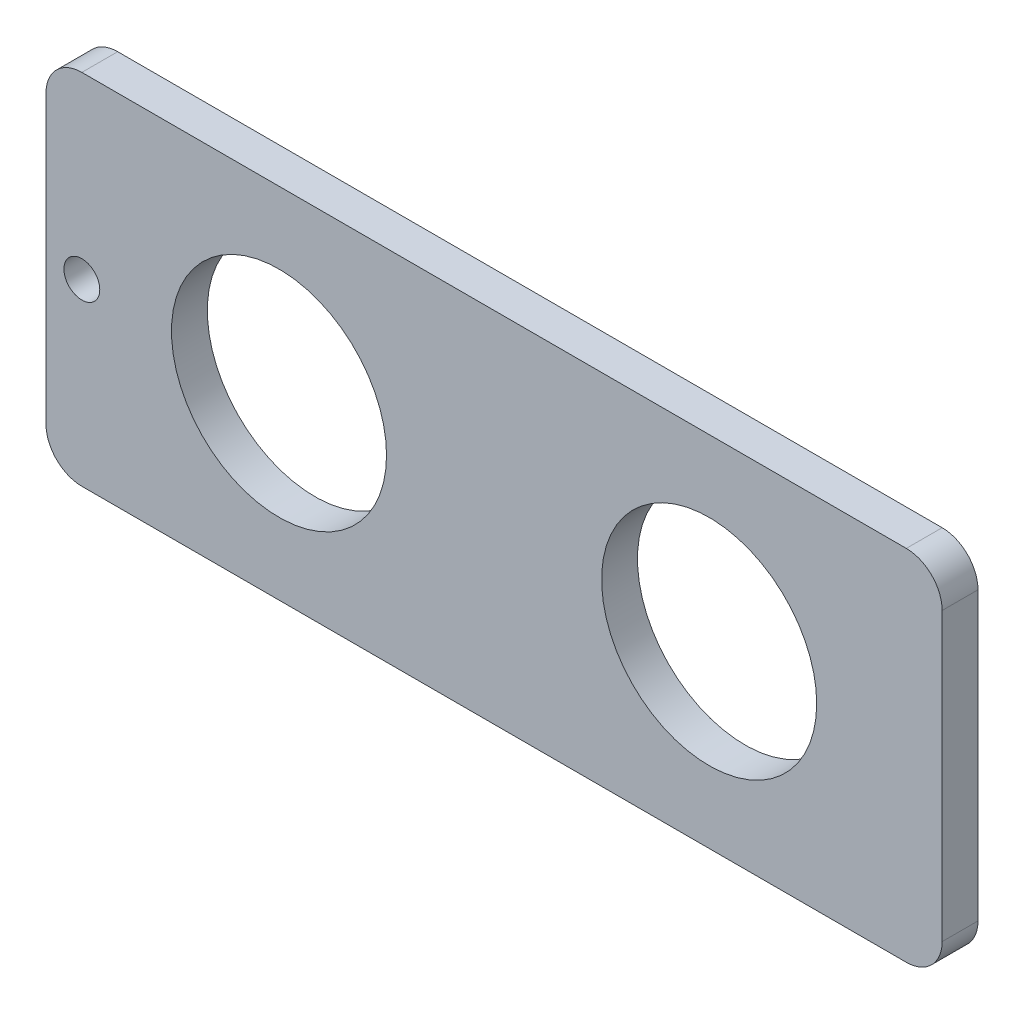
ISO-10303-21;
HEADER;
FILE_DESCRIPTION(('STEP AP214'),'2;1');
FILE_NAME('part.step','',(''),(''),'','','');
FILE_SCHEMA(('AUTOMOTIVE_DESIGN { 1 0 10303 214 1 1 1 1 }'));
ENDSEC;
DATA;
#1=APPLICATION_CONTEXT('core data for automotive mechanical design processes');
#2=APPLICATION_PROTOCOL_DEFINITION('international standard','automotive_design',2000,#1);
#3=PRODUCT_CONTEXT('',#1,'mechanical');
#4=PRODUCT('Part','Part','',(#3));
#5=PRODUCT_RELATED_PRODUCT_CATEGORY('part','',(#4));
#6=PRODUCT_DEFINITION_FORMATION('','',#4);
#7=PRODUCT_DEFINITION_CONTEXT('part definition',#1,'design');
#8=PRODUCT_DEFINITION('design','',#6,#7);
#9=PRODUCT_DEFINITION_SHAPE('','',#8);
#10=(LENGTH_UNIT() NAMED_UNIT(*) SI_UNIT(.MILLI.,.METRE.));
#11=(NAMED_UNIT(*) PLANE_ANGLE_UNIT() SI_UNIT($,.RADIAN.));
#12=(NAMED_UNIT(*) SI_UNIT($,.STERADIAN.) SOLID_ANGLE_UNIT());
#13=UNCERTAINTY_MEASURE_WITH_UNIT(LENGTH_MEASURE(1.E-05),#10,'distance_accuracy_value','');
#14=(GEOMETRIC_REPRESENTATION_CONTEXT(3) GLOBAL_UNCERTAINTY_ASSIGNED_CONTEXT((#13)) GLOBAL_UNIT_ASSIGNED_CONTEXT((#10,
#11,#12)) REPRESENTATION_CONTEXT('',''));
#15=CARTESIAN_POINT('',(0.,0.,0.));
#16=DIRECTION('',(0.,0.,1.));
#17=DIRECTION('',(1.,0.,0.));
#18=AXIS2_PLACEMENT_3D('',#15,#16,#17);
#19=CARTESIAN_POINT('',(11.5,4.,1.));
#20=DIRECTION('',(0.,0.,-1.));
#21=DIRECTION('',(-1.,0.,0.));
#22=AXIS2_PLACEMENT_3D('',#19,#20,#21);
#23=PLANE('',#22);
#24=CARTESIAN_POINT('',(6.,0.,1.));
#25=DIRECTION('',(0.,0.,1.));
#26=DIRECTION('',(1.,0.,0.));
#27=AXIS2_PLACEMENT_3D('',#24,#25,#26);
#28=CIRCLE('',#27,3.);
#29=CARTESIAN_POINT('',(9.,0.,1.));
#30=VERTEX_POINT('',#29);
#31=EDGE_CURVE('E179',#30,#30,#28,.T.);
#32=ORIENTED_EDGE('',*,*,#31,.F.);
#33=EDGE_LOOP('',(#32));
#34=FACE_BOUND('',#33,.T.);
#35=CARTESIAN_POINT('',(11.5,4.,1.));
#36=DIRECTION('',(0.,0.,1.));
#37=DIRECTION('',(-1.,0.,0.));
#38=AXIS2_PLACEMENT_3D('',#35,#36,#37);
#39=CIRCLE('',#38,1.);
#40=CARTESIAN_POINT('',(12.5,3.99999999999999,1.));
#41=VERTEX_POINT('',#40);
#42=CARTESIAN_POINT('',(11.5,5.,1.));
#43=VERTEX_POINT('',#42);
#44=EDGE_CURVE('E142',#41,#43,#39,.T.);
#45=ORIENTED_EDGE('',*,*,#44,.T.);
#46=DIRECTION('',(-1.,0.,0.));
#47=VECTOR('',#46,1.);
#48=CARTESIAN_POINT('',(-11.5,5.,1.));
#49=LINE('',#48,#47);
#50=CARTESIAN_POINT('',(-11.5,5.,1.));
#51=VERTEX_POINT('',#50);
#52=EDGE_CURVE('E90',#43,#51,#49,.T.);
#53=ORIENTED_EDGE('',*,*,#52,.T.);
#54=CARTESIAN_POINT('',(-11.5,4.,1.));
#55=DIRECTION('',(0.,0.,1.));
#56=DIRECTION('',(-1.,0.,0.));
#57=AXIS2_PLACEMENT_3D('',#54,#55,#56);
#58=CIRCLE('',#57,1.);
#59=CARTESIAN_POINT('',(-12.5,3.99999999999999,1.));
#60=VERTEX_POINT('',#59);
#61=EDGE_CURVE('E157',#51,#60,#58,.T.);
#62=ORIENTED_EDGE('',*,*,#61,.T.);
#63=DIRECTION('',(0.,-1.,0.));
#64=VECTOR('',#63,1.);
#65=CARTESIAN_POINT('',(-12.5,-3.99999999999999,1.));
#66=LINE('',#65,#64);
#67=CARTESIAN_POINT('',(-12.5,-3.99999999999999,1.));
#68=VERTEX_POINT('',#67);
#69=EDGE_CURVE('E170',#60,#68,#66,.T.);
#70=ORIENTED_EDGE('',*,*,#69,.T.);
#71=CARTESIAN_POINT('',(-11.5,-4.,1.));
#72=DIRECTION('',(0.,0.,1.));
#73=DIRECTION('',(-1.,0.,0.));
#74=AXIS2_PLACEMENT_3D('',#71,#72,#73);
#75=CIRCLE('',#74,1.);
#76=CARTESIAN_POINT('',(-11.5,-5.,1.));
#77=VERTEX_POINT('',#76);
#78=EDGE_CURVE('E109',#68,#77,#75,.T.);
#79=ORIENTED_EDGE('',*,*,#78,.T.);
#80=DIRECTION('',(1.,0.,0.));
#81=VECTOR('',#80,1.);
#82=CARTESIAN_POINT('',(-11.5,-5.,1.));
#83=LINE('',#82,#81);
#84=CARTESIAN_POINT('',(11.5,-5.,1.));
#85=VERTEX_POINT('',#84);
#86=EDGE_CURVE('E103',#77,#85,#83,.T.);
#87=ORIENTED_EDGE('',*,*,#86,.T.);
#88=CARTESIAN_POINT('',(11.5,-4.,1.));
#89=DIRECTION('',(0.,0.,1.));
#90=DIRECTION('',(1.,0.,0.));
#91=AXIS2_PLACEMENT_3D('',#88,#89,#90);
#92=CIRCLE('',#91,1.);
#93=CARTESIAN_POINT('',(12.5,-3.99999999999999,1.));
#94=VERTEX_POINT('',#93);
#95=EDGE_CURVE('E107',#85,#94,#92,.T.);
#96=ORIENTED_EDGE('',*,*,#95,.T.);
#97=DIRECTION('',(0.,1.,0.));
#98=VECTOR('',#97,1.);
#99=CARTESIAN_POINT('',(12.5,-3.99999999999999,1.));
#100=LINE('',#99,#98);
#101=EDGE_CURVE('E47',#94,#41,#100,.T.);
#102=ORIENTED_EDGE('',*,*,#101,.T.);
#103=EDGE_LOOP('',(#45,#53,#62,#70,#79,#87,#96,#102));
#104=FACE_BOUND('',#103,.T.);
#105=CARTESIAN_POINT('',(-6.,0.,1.));
#106=DIRECTION('',(0.,0.,1.));
#107=DIRECTION('',(1.,0.,0.));
#108=AXIS2_PLACEMENT_3D('',#105,#106,#107);
#109=CIRCLE('',#108,3.);
#110=CARTESIAN_POINT('',(-3.,0.,1.));
#111=VERTEX_POINT('',#110);
#112=EDGE_CURVE('E131',#111,#111,#109,.T.);
#113=ORIENTED_EDGE('',*,*,#112,.F.);
#114=EDGE_LOOP('',(#113));
#115=FACE_BOUND('',#114,.T.);
#116=CARTESIAN_POINT('',(-11.5,0.,1.));
#117=DIRECTION('',(0.,0.,1.));
#118=DIRECTION('',(1.,0.,0.));
#119=AXIS2_PLACEMENT_3D('',#116,#117,#118);
#120=CIRCLE('',#119,0.500000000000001);
#121=CARTESIAN_POINT('',(-11.,0.,1.));
#122=VERTEX_POINT('',#121);
#123=EDGE_CURVE('E185',#122,#122,#120,.T.);
#124=ORIENTED_EDGE('',*,*,#123,.F.);
#125=EDGE_LOOP('',(#124));
#126=FACE_BOUND('',#125,.T.);
#127=ADVANCED_FACE('F30',(#34,#104,#115,#126),#23,.F.);
#128=CARTESIAN_POINT('',(11.5,4.,0.));
#129=DIRECTION('',(0.,0.,-1.));
#130=DIRECTION('',(-1.,0.,0.));
#131=AXIS2_PLACEMENT_3D('',#128,#129,#130);
#132=PLANE('',#131);
#133=CARTESIAN_POINT('',(6.,0.,0.));
#134=DIRECTION('',(0.,0.,1.));
#135=DIRECTION('',(1.,0.,0.));
#136=AXIS2_PLACEMENT_3D('',#133,#134,#135);
#137=CIRCLE('',#136,3.);
#138=CARTESIAN_POINT('',(9.,0.,0.));
#139=VERTEX_POINT('',#138);
#140=EDGE_CURVE('E182',#139,#139,#137,.T.);
#141=ORIENTED_EDGE('',*,*,#140,.T.);
#142=EDGE_LOOP('',(#141));
#143=FACE_BOUND('',#142,.T.);
#144=CARTESIAN_POINT('',(11.5,4.,0.));
#145=DIRECTION('',(0.,0.,1.));
#146=DIRECTION('',(-1.,0.,0.));
#147=AXIS2_PLACEMENT_3D('',#144,#145,#146);
#148=CIRCLE('',#147,1.);
#149=CARTESIAN_POINT('',(12.5,3.99999999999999,0.));
#150=VERTEX_POINT('',#149);
#151=CARTESIAN_POINT('',(11.5,5.,0.));
#152=VERTEX_POINT('',#151);
#153=EDGE_CURVE('E127',#150,#152,#148,.T.);
#154=ORIENTED_EDGE('',*,*,#153,.F.);
#155=DIRECTION('',(0.,1.,0.));
#156=VECTOR('',#155,1.);
#157=CARTESIAN_POINT('',(12.5,-3.99999999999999,0.));
#158=LINE('',#157,#156);
#159=CARTESIAN_POINT('',(12.5,-3.99999999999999,0.));
#160=VERTEX_POINT('',#159);
#161=EDGE_CURVE('E82',#160,#150,#158,.T.);
#162=ORIENTED_EDGE('',*,*,#161,.F.);
#163=CARTESIAN_POINT('',(11.5,-4.,0.));
#164=DIRECTION('',(0.,0.,1.));
#165=DIRECTION('',(1.,0.,0.));
#166=AXIS2_PLACEMENT_3D('',#163,#164,#165);
#167=CIRCLE('',#166,1.);
#168=CARTESIAN_POINT('',(11.5,-5.,0.));
#169=VERTEX_POINT('',#168);
#170=EDGE_CURVE('E76',#169,#160,#167,.T.);
#171=ORIENTED_EDGE('',*,*,#170,.F.);
#172=DIRECTION('',(1.,0.,0.));
#173=VECTOR('',#172,1.);
#174=CARTESIAN_POINT('',(-11.5,-5.,0.));
#175=LINE('',#174,#173);
#176=CARTESIAN_POINT('',(-11.5,-5.,0.));
#177=VERTEX_POINT('',#176);
#178=EDGE_CURVE('E117',#177,#169,#175,.T.);
#179=ORIENTED_EDGE('',*,*,#178,.F.);
#180=CARTESIAN_POINT('',(-11.5,-4.,0.));
#181=DIRECTION('',(0.,0.,1.));
#182=DIRECTION('',(-1.,0.,0.));
#183=AXIS2_PLACEMENT_3D('',#180,#181,#182);
#184=CIRCLE('',#183,1.);
#185=CARTESIAN_POINT('',(-12.5,-3.99999999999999,0.));
#186=VERTEX_POINT('',#185);
#187=EDGE_CURVE('E137',#186,#177,#184,.T.);
#188=ORIENTED_EDGE('',*,*,#187,.F.);
#189=DIRECTION('',(0.,-1.,0.));
#190=VECTOR('',#189,1.);
#191=CARTESIAN_POINT('',(-12.5,-3.99999999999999,0.));
#192=LINE('',#191,#190);
#193=CARTESIAN_POINT('',(-12.5,3.99999999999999,0.));
#194=VERTEX_POINT('',#193);
#195=EDGE_CURVE('E135',#194,#186,#192,.T.);
#196=ORIENTED_EDGE('',*,*,#195,.F.);
#197=CARTESIAN_POINT('',(-11.5,4.,0.));
#198=DIRECTION('',(0.,0.,1.));
#199=DIRECTION('',(-1.,0.,0.));
#200=AXIS2_PLACEMENT_3D('',#197,#198,#199);
#201=CIRCLE('',#200,1.);
#202=CARTESIAN_POINT('',(-11.5,5.,0.));
#203=VERTEX_POINT('',#202);
#204=EDGE_CURVE('E133',#203,#194,#201,.T.);
#205=ORIENTED_EDGE('',*,*,#204,.F.);
#206=DIRECTION('',(-1.,0.,0.));
#207=VECTOR('',#206,1.);
#208=CARTESIAN_POINT('',(-11.5,5.,0.));
#209=LINE('',#208,#207);
#210=EDGE_CURVE('E130',#152,#203,#209,.T.);
#211=ORIENTED_EDGE('',*,*,#210,.F.);
#212=EDGE_LOOP('',(#154,#162,#171,#179,#188,#196,#205,#211));
#213=FACE_BOUND('',#212,.T.);
#214=CARTESIAN_POINT('',(-6.,0.,0.));
#215=DIRECTION('',(0.,0.,1.));
#216=DIRECTION('',(1.,0.,0.));
#217=AXIS2_PLACEMENT_3D('',#214,#215,#216);
#218=CIRCLE('',#217,3.);
#219=CARTESIAN_POINT('',(-3.,0.,0.));
#220=VERTEX_POINT('',#219);
#221=EDGE_CURVE('E176',#220,#220,#218,.T.);
#222=ORIENTED_EDGE('',*,*,#221,.T.);
#223=EDGE_LOOP('',(#222));
#224=FACE_BOUND('',#223,.T.);
#225=CARTESIAN_POINT('',(-11.5,0.,0.));
#226=DIRECTION('',(0.,0.,1.));
#227=DIRECTION('',(1.,0.,0.));
#228=AXIS2_PLACEMENT_3D('',#225,#226,#227);
#229=CIRCLE('',#228,0.500000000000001);
#230=CARTESIAN_POINT('',(-11.,0.,0.));
#231=VERTEX_POINT('',#230);
#232=EDGE_CURVE('E188',#231,#231,#229,.T.);
#233=ORIENTED_EDGE('',*,*,#232,.T.);
#234=EDGE_LOOP('',(#233));
#235=FACE_BOUND('',#234,.T.);
#236=ADVANCED_FACE('F161',(#143,#213,#224,#235),#132,.T.);
#237=CARTESIAN_POINT('',(11.5,4.,1.));
#238=DIRECTION('',(0.,0.,-1.));
#239=DIRECTION('',(-1.,0.,0.));
#240=AXIS2_PLACEMENT_3D('',#237,#238,#239);
#241=CYLINDRICAL_SURFACE('',#240,1.);
#242=ORIENTED_EDGE('',*,*,#153,.T.);
#243=DIRECTION('',(0.,0.,-1.));
#244=VECTOR('',#243,1.);
#245=CARTESIAN_POINT('',(11.5,5.,1.));
#246=LINE('',#245,#244);
#247=EDGE_CURVE('E11',#43,#152,#246,.T.);
#248=ORIENTED_EDGE('',*,*,#247,.F.);
#249=ORIENTED_EDGE('',*,*,#44,.F.);
#250=DIRECTION('',(0.,0.,-1.));
#251=VECTOR('',#250,1.);
#252=CARTESIAN_POINT('',(12.5,3.99999999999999,1.));
#253=LINE('',#252,#251);
#254=EDGE_CURVE('E123',#41,#150,#253,.T.);
#255=ORIENTED_EDGE('',*,*,#254,.T.);
#256=EDGE_LOOP('',(#242,#248,#249,#255));
#257=FACE_BOUND('',#256,.T.);
#258=ADVANCED_FACE('F32',(#257),#241,.T.);
#259=CARTESIAN_POINT('',(-11.5,5.,1.));
#260=DIRECTION('',(0.,-1.,0.));
#261=DIRECTION('',(0.,0.,-1.));
#262=AXIS2_PLACEMENT_3D('',#259,#260,#261);
#263=PLANE('',#262);
#264=ORIENTED_EDGE('',*,*,#210,.T.);
#265=DIRECTION('',(0.,0.,-1.));
#266=VECTOR('',#265,1.);
#267=CARTESIAN_POINT('',(-11.5,5.,1.));
#268=LINE('',#267,#266);
#269=EDGE_CURVE('E39',#51,#203,#268,.T.);
#270=ORIENTED_EDGE('',*,*,#269,.F.);
#271=ORIENTED_EDGE('',*,*,#52,.F.);
#272=ORIENTED_EDGE('',*,*,#247,.T.);
#273=EDGE_LOOP('',(#264,#270,#271,#272));
#274=FACE_BOUND('',#273,.T.);
#275=ADVANCED_FACE('F222',(#274),#263,.F.);
#276=CARTESIAN_POINT('',(-11.5,4.,1.));
#277=DIRECTION('',(0.,0.,-1.));
#278=DIRECTION('',(-1.,0.,0.));
#279=AXIS2_PLACEMENT_3D('',#276,#277,#278);
#280=CYLINDRICAL_SURFACE('',#279,1.);
#281=ORIENTED_EDGE('',*,*,#204,.T.);
#282=DIRECTION('',(0.,0.,-1.));
#283=VECTOR('',#282,1.);
#284=CARTESIAN_POINT('',(-12.5,3.99999999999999,1.));
#285=LINE('',#284,#283);
#286=EDGE_CURVE('E149',#60,#194,#285,.T.);
#287=ORIENTED_EDGE('',*,*,#286,.F.);
#288=ORIENTED_EDGE('',*,*,#61,.F.);
#289=ORIENTED_EDGE('',*,*,#269,.T.);
#290=EDGE_LOOP('',(#281,#287,#288,#289));
#291=FACE_BOUND('',#290,.T.);
#292=ADVANCED_FACE('F155',(#291),#280,.T.);
#293=CARTESIAN_POINT('',(-12.5,-3.99999999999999,1.));
#294=DIRECTION('',(1.,0.,0.));
#295=DIRECTION('',(0.,0.,-1.));
#296=AXIS2_PLACEMENT_3D('',#293,#294,#295);
#297=PLANE('',#296);
#298=ORIENTED_EDGE('',*,*,#195,.T.);
#299=DIRECTION('',(0.,0.,-1.));
#300=VECTOR('',#299,1.);
#301=CARTESIAN_POINT('',(-12.5,-3.99999999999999,1.));
#302=LINE('',#301,#300);
#303=EDGE_CURVE('E146',#68,#186,#302,.T.);
#304=ORIENTED_EDGE('',*,*,#303,.F.);
#305=ORIENTED_EDGE('',*,*,#69,.F.);
#306=ORIENTED_EDGE('',*,*,#286,.T.);
#307=EDGE_LOOP('',(#298,#304,#305,#306));
#308=FACE_BOUND('',#307,.T.);
#309=ADVANCED_FACE('F166',(#308),#297,.F.);
#310=CARTESIAN_POINT('',(-11.5,-4.,1.));
#311=DIRECTION('',(0.,0.,-1.));
#312=DIRECTION('',(-1.,0.,0.));
#313=AXIS2_PLACEMENT_3D('',#310,#311,#312);
#314=CYLINDRICAL_SURFACE('',#313,1.);
#315=ORIENTED_EDGE('',*,*,#187,.T.);
#316=DIRECTION('',(0.,0.,-1.));
#317=VECTOR('',#316,1.);
#318=CARTESIAN_POINT('',(-11.5,-5.,1.));
#319=LINE('',#318,#317);
#320=EDGE_CURVE('E118',#77,#177,#319,.T.);
#321=ORIENTED_EDGE('',*,*,#320,.F.);
#322=ORIENTED_EDGE('',*,*,#78,.F.);
#323=ORIENTED_EDGE('',*,*,#303,.T.);
#324=EDGE_LOOP('',(#315,#321,#322,#323));
#325=FACE_BOUND('',#324,.T.);
#326=ADVANCED_FACE('F169',(#325),#314,.T.);
#327=CARTESIAN_POINT('',(-11.5,-5.,1.));
#328=DIRECTION('',(0.,1.,0.));
#329=DIRECTION('',(0.,0.,1.));
#330=AXIS2_PLACEMENT_3D('',#327,#328,#329);
#331=PLANE('',#330);
#332=ORIENTED_EDGE('',*,*,#178,.T.);
#333=DIRECTION('',(0.,0.,-1.));
#334=VECTOR('',#333,1.);
#335=CARTESIAN_POINT('',(11.5,-5.,1.));
#336=LINE('',#335,#334);
#337=EDGE_CURVE('E114',#85,#169,#336,.T.);
#338=ORIENTED_EDGE('',*,*,#337,.F.);
#339=ORIENTED_EDGE('',*,*,#86,.F.);
#340=ORIENTED_EDGE('',*,*,#320,.T.);
#341=EDGE_LOOP('',(#332,#338,#339,#340));
#342=FACE_BOUND('',#341,.T.);
#343=ADVANCED_FACE('F115',(#342),#331,.F.);
#344=CARTESIAN_POINT('',(11.5,-4.,1.));
#345=DIRECTION('',(0.,0.,-1.));
#346=DIRECTION('',(-1.,0.,0.));
#347=AXIS2_PLACEMENT_3D('',#344,#345,#346);
#348=CYLINDRICAL_SURFACE('',#347,1.);
#349=ORIENTED_EDGE('',*,*,#170,.T.);
#350=DIRECTION('',(0.,0.,-1.));
#351=VECTOR('',#350,1.);
#352=CARTESIAN_POINT('',(12.5,-3.99999999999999,1.));
#353=LINE('',#352,#351);
#354=EDGE_CURVE('E119',#94,#160,#353,.T.);
#355=ORIENTED_EDGE('',*,*,#354,.F.);
#356=ORIENTED_EDGE('',*,*,#95,.F.);
#357=ORIENTED_EDGE('',*,*,#337,.T.);
#358=EDGE_LOOP('',(#349,#355,#356,#357));
#359=FACE_BOUND('',#358,.T.);
#360=ADVANCED_FACE('F121',(#359),#348,.T.);
#361=CARTESIAN_POINT('',(12.5,-3.99999999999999,1.));
#362=DIRECTION('',(-1.,0.,0.));
#363=DIRECTION('',(0.,0.,1.));
#364=AXIS2_PLACEMENT_3D('',#361,#362,#363);
#365=PLANE('',#364);
#366=ORIENTED_EDGE('',*,*,#161,.T.);
#367=ORIENTED_EDGE('',*,*,#254,.F.);
#368=ORIENTED_EDGE('',*,*,#101,.F.);
#369=ORIENTED_EDGE('',*,*,#354,.T.);
#370=EDGE_LOOP('',(#366,#367,#368,#369));
#371=FACE_BOUND('',#370,.T.);
#372=ADVANCED_FACE('F210',(#371),#365,.F.);
#373=CARTESIAN_POINT('',(-6.,0.,1.));
#374=DIRECTION('',(0.,0.,-1.));
#375=DIRECTION('',(-1.,0.,0.));
#376=AXIS2_PLACEMENT_3D('',#373,#374,#375);
#377=CYLINDRICAL_SURFACE('',#376,3.);
#378=ORIENTED_EDGE('',*,*,#112,.T.);
#379=EDGE_LOOP('',(#378));
#380=FACE_BOUND('',#379,.T.);
#381=ORIENTED_EDGE('',*,*,#221,.F.);
#382=EDGE_LOOP('',(#381));
#383=FACE_BOUND('',#382,.T.);
#384=ADVANCED_FACE('F207',(#380,#383),#377,.F.);
#385=CARTESIAN_POINT('',(6.,0.,1.));
#386=DIRECTION('',(0.,0.,-1.));
#387=DIRECTION('',(-1.,0.,0.));
#388=AXIS2_PLACEMENT_3D('',#385,#386,#387);
#389=CYLINDRICAL_SURFACE('',#388,3.);
#390=ORIENTED_EDGE('',*,*,#31,.T.);
#391=EDGE_LOOP('',(#390));
#392=FACE_BOUND('',#391,.T.);
#393=ORIENTED_EDGE('',*,*,#140,.F.);
#394=EDGE_LOOP('',(#393));
#395=FACE_BOUND('',#394,.T.);
#396=ADVANCED_FACE('F286',(#392,#395),#389,.F.);
#397=CARTESIAN_POINT('',(-11.5,0.,1.));
#398=DIRECTION('',(0.,0.,-1.));
#399=DIRECTION('',(-1.,0.,0.));
#400=AXIS2_PLACEMENT_3D('',#397,#398,#399);
#401=CYLINDRICAL_SURFACE('',#400,0.500000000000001);
#402=ORIENTED_EDGE('',*,*,#123,.T.);
#403=EDGE_LOOP('',(#402));
#404=FACE_BOUND('',#403,.T.);
#405=ORIENTED_EDGE('',*,*,#232,.F.);
#406=EDGE_LOOP('',(#405));
#407=FACE_BOUND('',#406,.T.);
#408=ADVANCED_FACE('F194',(#404,#407),#401,.F.);
#409=CLOSED_SHELL('',(#127,#236,#258,#275,#292,#309,#326,#343,#360,#372,#384,#396,#408));
#410=MANIFOLD_SOLID_BREP('B2',#409);
#411=ADVANCED_BREP_SHAPE_REPRESENTATION('',(#18,#410),#14);
#412=SHAPE_DEFINITION_REPRESENTATION(#9,#411);
ENDSEC;
END-ISO-10303-21;
